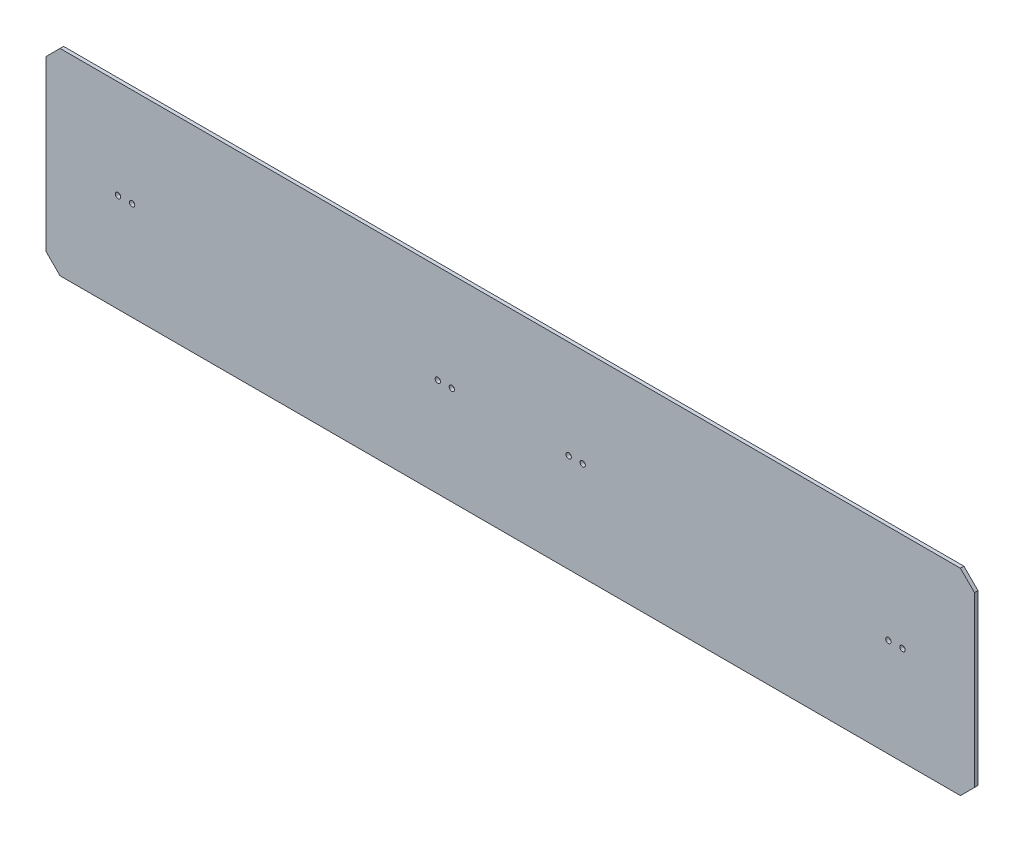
from build123d import *

# Parameters (mm, degrees)
SKETCH1_W          = 1676.4
SKETCH1_H          = 355.6
EXTRUDE1_DEPTH     = 6.35
CHAMFER2_SIZE      = 25.4
SKETCH3_R          = 4.826
CUT_EXTRUDE2_DEPTH = 1550.296818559


with BuildPart() as part:
    # Sketch1 → Extrude1 (new body)
    with BuildSketch(Plane.XY):
        with Locations((672.608528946, 165.329564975)):
            Rectangle(SKETCH1_W, SKETCH1_H)
    extrude(amount=EXTRUDE1_DEPTH)

    # Chamfer2
    chamfer2_edges = [part.edges().sort_by_distance(p)[0] for p in [
        (-165.591471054, 343.129564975, 3.175),
        (1510.808528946, 343.129564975, 3.175),
        (1510.808528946, -12.470435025, 3.175),
        (-165.591471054, -12.470435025, 3.175),
    ]]
    chamfer(chamfer2_edges, length=CHAMFER2_SIZE)

    # Sketch3 → Cut-Extrude2 (cut, through all)
    with BuildSketch(Plane(origin=(0, 0, 0), x_dir=(-1, 0, 0), z_dir=(0, 0, -1))):
        with Locations((-1380.760528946, 165.329564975)):
            Circle(SKETCH3_R)
        with Locations((-1355.360528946, 165.329564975)):
            Circle(SKETCH3_R)
        with Locations((-803.418528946, 165.329564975)):
            Circle(SKETCH3_R)
        with Locations((-778.018528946, 165.329564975)):
            Circle(SKETCH3_R)
        with Locations((-567.198528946, 165.329564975)):
            Circle(SKETCH3_R)
        with Locations((-541.798528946, 165.329564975)):
            Circle(SKETCH3_R)
        with Locations((35.543471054, 165.329564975)):
            Circle(SKETCH3_R)
        with Locations((10.143471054, 165.329564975)):
            Circle(SKETCH3_R)
    extrude(amount=-CUT_EXTRUDE2_DEPTH, mode=Mode.SUBTRACT)


solid = part.part
